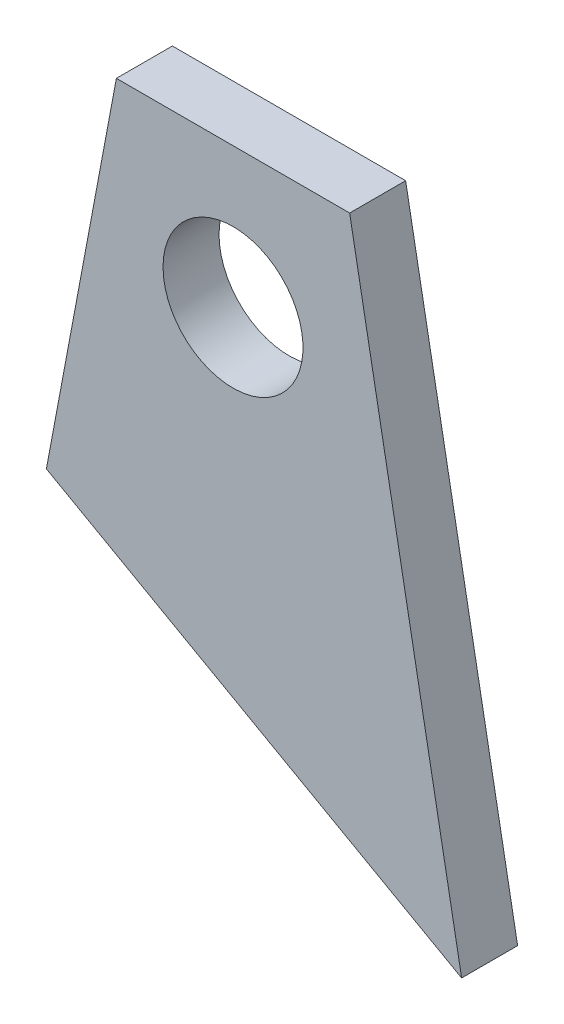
ISO-10303-21;
HEADER;
FILE_DESCRIPTION(('STEP AP214'),'2;1');
FILE_NAME('part.step','',(''),(''),'','','');
FILE_SCHEMA(('AUTOMOTIVE_DESIGN { 1 0 10303 214 1 1 1 1 }'));
ENDSEC;
DATA;
#1=APPLICATION_CONTEXT('core data for automotive mechanical design processes');
#2=APPLICATION_PROTOCOL_DEFINITION('international standard','automotive_design',2000,#1);
#3=PRODUCT_CONTEXT('',#1,'mechanical');
#4=PRODUCT('Part','Part','',(#3));
#5=PRODUCT_RELATED_PRODUCT_CATEGORY('part','',(#4));
#6=PRODUCT_DEFINITION_FORMATION('','',#4);
#7=PRODUCT_DEFINITION_CONTEXT('part definition',#1,'design');
#8=PRODUCT_DEFINITION('design','',#6,#7);
#9=PRODUCT_DEFINITION_SHAPE('','',#8);
#10=(LENGTH_UNIT() NAMED_UNIT(*) SI_UNIT(.MILLI.,.METRE.));
#11=(NAMED_UNIT(*) PLANE_ANGLE_UNIT() SI_UNIT($,.RADIAN.));
#12=(NAMED_UNIT(*) SI_UNIT($,.STERADIAN.) SOLID_ANGLE_UNIT());
#13=UNCERTAINTY_MEASURE_WITH_UNIT(LENGTH_MEASURE(1.E-05),#10,'distance_accuracy_value','');
#14=(GEOMETRIC_REPRESENTATION_CONTEXT(3) GLOBAL_UNCERTAINTY_ASSIGNED_CONTEXT((#13)) GLOBAL_UNIT_ASSIGNED_CONTEXT((#10,
#11,#12)) REPRESENTATION_CONTEXT('',''));
#15=CARTESIAN_POINT('',(0.,0.,0.));
#16=DIRECTION('',(0.,0.,1.));
#17=DIRECTION('',(1.,0.,0.));
#18=AXIS2_PLACEMENT_3D('',#15,#16,#17);
#19=CARTESIAN_POINT('',(-25.,0.,11.9999999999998));
#20=DIRECTION('',(0.,0.,-0.999999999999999));
#21=DIRECTION('',(-1.,0.,0.));
#22=AXIS2_PLACEMENT_3D('',#19,#20,#21);
#23=PLANE('',#22);
#24=DIRECTION('',(-0.184288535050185,-0.982872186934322,0.));
#25=VECTOR('',#24,1.);
#26=CARTESIAN_POINT('',(-40.0000000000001,-79.9999999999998,11.9999999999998));
#27=LINE('',#26,#25);
#28=CARTESIAN_POINT('',(-25.,0.,11.9999999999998));
#29=VERTEX_POINT('',#28);
#30=CARTESIAN_POINT('',(-40.0000000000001,-79.9999999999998,11.9999999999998));
#31=VERTEX_POINT('',#30);
#32=EDGE_CURVE('E110',#29,#31,#27,.T.);
#33=ORIENTED_EDGE('',*,*,#32,.T.);
#34=DIRECTION('',(0.87183702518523,-0.489796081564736,0.));
#35=VECTOR('',#34,1.);
#36=CARTESIAN_POINT('',(48.9999999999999,-130.,12.));
#37=LINE('',#36,#35);
#38=CARTESIAN_POINT('',(48.9999999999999,-130.,12.));
#39=VERTEX_POINT('',#38);
#40=EDGE_CURVE('E95',#31,#39,#37,.T.);
#41=ORIENTED_EDGE('',*,*,#40,.T.);
#42=DIRECTION('',(-0.181547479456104,0.983382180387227,0.));
#43=VECTOR('',#42,1.);
#44=CARTESIAN_POINT('',(25.,2.22044604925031E-13,11.9999999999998));
#45=LINE('',#44,#43);
#46=CARTESIAN_POINT('',(25.,2.22044604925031E-13,11.9999999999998));
#47=VERTEX_POINT('',#46);
#48=EDGE_CURVE('E61',#39,#47,#45,.T.);
#49=ORIENTED_EDGE('',*,*,#48,.T.);
#50=DIRECTION('',(-1.,0.,0.));
#51=VECTOR('',#50,1.);
#52=CARTESIAN_POINT('',(-25.,0.,11.9999999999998));
#53=LINE('',#52,#51);
#54=EDGE_CURVE('E56',#47,#29,#53,.T.);
#55=ORIENTED_EDGE('',*,*,#54,.T.);
#56=EDGE_LOOP('',(#33,#41,#49,#55));
#57=FACE_BOUND('',#56,.T.);
#58=CARTESIAN_POINT('',(1.11022302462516E-13,-29.9999999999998,11.9999999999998));
#59=DIRECTION('',(0.,0.,0.999999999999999));
#60=DIRECTION('',(1.,0.,0.));
#61=AXIS2_PLACEMENT_3D('',#58,#59,#60);
#62=CIRCLE('',#61,15.);
#63=CARTESIAN_POINT('',(-14.9999999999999,-29.9999999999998,11.9999999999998));
#64=VERTEX_POINT('',#63);
#65=EDGE_CURVE('E100',#64,#64,#62,.T.);
#66=ORIENTED_EDGE('',*,*,#65,.F.);
#67=EDGE_LOOP('',(#66));
#68=FACE_BOUND('',#67,.T.);
#69=ADVANCED_FACE('F41',(#57,#68),#23,.F.);
#70=CARTESIAN_POINT('',(-25.,0.,-2.22044604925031E-13));
#71=DIRECTION('',(0.,0.,-0.999999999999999));
#72=DIRECTION('',(-1.,0.,0.));
#73=AXIS2_PLACEMENT_3D('',#70,#71,#72);
#74=PLANE('',#73);
#75=DIRECTION('',(-0.184288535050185,-0.982872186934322,0.));
#76=VECTOR('',#75,1.);
#77=CARTESIAN_POINT('',(-40.0000000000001,-79.9999999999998,-2.22044604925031E-13));
#78=LINE('',#77,#76);
#79=CARTESIAN_POINT('',(-25.,0.,-2.22044604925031E-13));
#80=VERTEX_POINT('',#79);
#81=CARTESIAN_POINT('',(-40.0000000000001,-79.9999999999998,-2.22044604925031E-13));
#82=VERTEX_POINT('',#81);
#83=EDGE_CURVE('E87',#80,#82,#78,.T.);
#84=ORIENTED_EDGE('',*,*,#83,.F.);
#85=DIRECTION('',(-1.,0.,0.));
#86=VECTOR('',#85,1.);
#87=CARTESIAN_POINT('',(-25.,0.,-2.22044604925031E-13));
#88=LINE('',#87,#86);
#89=CARTESIAN_POINT('',(25.,2.22044604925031E-13,-2.22044604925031E-13));
#90=VERTEX_POINT('',#89);
#91=EDGE_CURVE('E108',#90,#80,#88,.T.);
#92=ORIENTED_EDGE('',*,*,#91,.F.);
#93=DIRECTION('',(-0.181547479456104,0.983382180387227,0.));
#94=VECTOR('',#93,1.);
#95=CARTESIAN_POINT('',(25.,2.22044604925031E-13,-2.22044604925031E-13));
#96=LINE('',#95,#94);
#97=CARTESIAN_POINT('',(48.9999999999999,-130.,0.));
#98=VERTEX_POINT('',#97);
#99=EDGE_CURVE('E88',#98,#90,#96,.T.);
#100=ORIENTED_EDGE('',*,*,#99,.F.);
#101=DIRECTION('',(0.87183702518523,-0.489796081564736,0.));
#102=VECTOR('',#101,1.);
#103=CARTESIAN_POINT('',(48.9999999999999,-130.,0.));
#104=LINE('',#103,#102);
#105=EDGE_CURVE('E82',#82,#98,#104,.T.);
#106=ORIENTED_EDGE('',*,*,#105,.F.);
#107=EDGE_LOOP('',(#84,#92,#100,#106));
#108=FACE_BOUND('',#107,.T.);
#109=CARTESIAN_POINT('',(1.11022302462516E-13,-29.9999999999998,-2.22044604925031E-13));
#110=DIRECTION('',(0.,0.,0.999999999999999));
#111=DIRECTION('',(1.,0.,0.));
#112=AXIS2_PLACEMENT_3D('',#109,#110,#111);
#113=CIRCLE('',#112,15.);
#114=CARTESIAN_POINT('',(-14.9999999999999,-29.9999999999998,-2.23779328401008E-13));
#115=VERTEX_POINT('',#114);
#116=EDGE_CURVE('E103',#115,#115,#113,.T.);
#117=ORIENTED_EDGE('',*,*,#116,.T.);
#118=EDGE_LOOP('',(#117));
#119=FACE_BOUND('',#118,.T.);
#120=ADVANCED_FACE('F83',(#108,#119),#74,.T.);
#121=CARTESIAN_POINT('',(-40.0000000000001,-79.9999999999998,11.9999999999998));
#122=DIRECTION('',(0.982872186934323,-0.184288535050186,0.));
#123=DIRECTION('',(0.184288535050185,0.982872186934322,0.));
#124=AXIS2_PLACEMENT_3D('',#121,#122,#123);
#125=PLANE('',#124);
#126=ORIENTED_EDGE('',*,*,#83,.T.);
#127=DIRECTION('',(0.,0.,-0.999999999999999));
#128=VECTOR('',#127,1.);
#129=CARTESIAN_POINT('',(-40.0000000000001,-79.9999999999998,11.9999999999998));
#130=LINE('',#129,#128);
#131=EDGE_CURVE('E11',#31,#82,#130,.T.);
#132=ORIENTED_EDGE('',*,*,#131,.F.);
#133=ORIENTED_EDGE('',*,*,#32,.F.);
#134=DIRECTION('',(0.,0.,-0.999999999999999));
#135=VECTOR('',#134,1.);
#136=CARTESIAN_POINT('',(-25.,0.,11.9999999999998));
#137=LINE('',#136,#135);
#138=EDGE_CURVE('E99',#29,#80,#137,.T.);
#139=ORIENTED_EDGE('',*,*,#138,.T.);
#140=EDGE_LOOP('',(#126,#132,#133,#139));
#141=FACE_BOUND('',#140,.T.);
#142=ADVANCED_FACE('F43',(#141),#125,.F.);
#143=CARTESIAN_POINT('',(48.9999999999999,-130.,12.));
#144=DIRECTION('',(0.489796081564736,0.87183702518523,0.));
#145=DIRECTION('',(-0.87183702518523,0.489796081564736,0.));
#146=AXIS2_PLACEMENT_3D('',#143,#144,#145);
#147=PLANE('',#146);
#148=ORIENTED_EDGE('',*,*,#105,.T.);
#149=DIRECTION('',(0.,0.,-0.999999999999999));
#150=VECTOR('',#149,1.);
#151=CARTESIAN_POINT('',(48.9999999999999,-130.,12.));
#152=LINE('',#151,#150);
#153=EDGE_CURVE('E49',#39,#98,#152,.T.);
#154=ORIENTED_EDGE('',*,*,#153,.F.);
#155=ORIENTED_EDGE('',*,*,#40,.F.);
#156=ORIENTED_EDGE('',*,*,#131,.T.);
#157=EDGE_LOOP('',(#148,#154,#155,#156));
#158=FACE_BOUND('',#157,.T.);
#159=ADVANCED_FACE('F94',(#158),#147,.F.);
#160=CARTESIAN_POINT('',(25.,2.22044604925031E-13,11.9999999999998));
#161=DIRECTION('',(-0.983382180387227,-0.181547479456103,0.));
#162=DIRECTION('',(0.181547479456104,-0.983382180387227,0.));
#163=AXIS2_PLACEMENT_3D('',#160,#161,#162);
#164=PLANE('',#163);
#165=ORIENTED_EDGE('',*,*,#99,.T.);
#166=DIRECTION('',(0.,0.,-0.999999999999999));
#167=VECTOR('',#166,1.);
#168=CARTESIAN_POINT('',(25.,2.22044604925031E-13,11.9999999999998));
#169=LINE('',#168,#167);
#170=EDGE_CURVE('E116',#47,#90,#169,.T.);
#171=ORIENTED_EDGE('',*,*,#170,.F.);
#172=ORIENTED_EDGE('',*,*,#48,.F.);
#173=ORIENTED_EDGE('',*,*,#153,.T.);
#174=EDGE_LOOP('',(#165,#171,#172,#173));
#175=FACE_BOUND('',#174,.T.);
#176=ADVANCED_FACE('F119',(#175),#164,.F.);
#177=CARTESIAN_POINT('',(-25.,0.,11.9999999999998));
#178=DIRECTION('',(0.,-1.,0.));
#179=DIRECTION('',(0.,0.,-0.999999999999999));
#180=AXIS2_PLACEMENT_3D('',#177,#178,#179);
#181=PLANE('',#180);
#182=ORIENTED_EDGE('',*,*,#91,.T.);
#183=ORIENTED_EDGE('',*,*,#138,.F.);
#184=ORIENTED_EDGE('',*,*,#54,.F.);
#185=ORIENTED_EDGE('',*,*,#170,.T.);
#186=EDGE_LOOP('',(#182,#183,#184,#185));
#187=FACE_BOUND('',#186,.T.);
#188=ADVANCED_FACE('F121',(#187),#181,.F.);
#189=CARTESIAN_POINT('',(1.11022302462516E-13,-29.9999999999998,11.9999999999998));
#190=DIRECTION('',(0.,0.,-0.999999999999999));
#191=DIRECTION('',(-1.,0.,0.));
#192=AXIS2_PLACEMENT_3D('',#189,#190,#191);
#193=CYLINDRICAL_SURFACE('',#192,15.);
#194=CARTESIAN_POINT('',(-14.9999999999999,-29.9999999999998,11.9999999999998));
#195=CARTESIAN_POINT('',(-14.9999999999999,-29.9999999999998,11.8749999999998));
#196=CARTESIAN_POINT('',(-14.9999999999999,-29.9999999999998,11.7499999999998));
#197=CARTESIAN_POINT('',(-14.9999999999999,-29.9999999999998,11.4999999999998));
#198=CARTESIAN_POINT('',(-14.9999999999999,-29.9999999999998,11.3749999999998));
#199=CARTESIAN_POINT('',(-14.9999999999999,-29.9999999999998,11.1249999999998));
#200=CARTESIAN_POINT('',(-14.9999999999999,-29.9999999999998,10.9999999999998));
#201=CARTESIAN_POINT('',(-14.9999999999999,-29.9999999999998,10.7499999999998));
#202=CARTESIAN_POINT('',(-14.9999999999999,-29.9999999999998,10.6249999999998));
#203=CARTESIAN_POINT('',(-14.9999999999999,-29.9999999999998,10.3749999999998));
#204=CARTESIAN_POINT('',(-14.9999999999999,-29.9999999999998,10.2499999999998));
#205=CARTESIAN_POINT('',(-14.9999999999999,-29.9999999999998,9.99999999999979));
#206=CARTESIAN_POINT('',(-14.9999999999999,-29.9999999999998,9.87499999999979));
#207=CARTESIAN_POINT('',(-14.9999999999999,-29.9999999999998,9.62499999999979));
#208=CARTESIAN_POINT('',(-14.9999999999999,-29.9999999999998,9.49999999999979));
#209=CARTESIAN_POINT('',(-14.9999999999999,-29.9999999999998,9.24999999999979));
#210=CARTESIAN_POINT('',(-14.9999999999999,-29.9999999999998,9.12499999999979));
#211=CARTESIAN_POINT('',(-14.9999999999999,-29.9999999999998,8.87499999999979));
#212=CARTESIAN_POINT('',(-14.9999999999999,-29.9999999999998,8.74999999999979));
#213=CARTESIAN_POINT('',(-14.9999999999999,-29.9999999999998,8.49999999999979));
#214=CARTESIAN_POINT('',(-14.9999999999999,-29.9999999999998,8.37499999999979));
#215=CARTESIAN_POINT('',(-14.9999999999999,-29.9999999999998,8.12499999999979));
#216=CARTESIAN_POINT('',(-14.9999999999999,-29.9999999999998,7.99999999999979));
#217=CARTESIAN_POINT('',(-14.9999999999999,-29.9999999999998,7.74999999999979));
#218=CARTESIAN_POINT('',(-14.9999999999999,-29.9999999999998,7.62499999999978));
#219=CARTESIAN_POINT('',(-14.9999999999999,-29.9999999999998,7.37499999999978));
#220=CARTESIAN_POINT('',(-14.9999999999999,-29.9999999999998,7.24999999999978));
#221=CARTESIAN_POINT('',(-14.9999999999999,-29.9999999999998,6.99999999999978));
#222=CARTESIAN_POINT('',(-14.9999999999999,-29.9999999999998,6.87499999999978));
#223=CARTESIAN_POINT('',(-14.9999999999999,-29.9999999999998,6.62499999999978));
#224=CARTESIAN_POINT('',(-14.9999999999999,-29.9999999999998,6.49999999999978));
#225=CARTESIAN_POINT('',(-14.9999999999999,-29.9999999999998,6.24999999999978));
#226=CARTESIAN_POINT('',(-14.9999999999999,-29.9999999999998,6.12499999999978));
#227=CARTESIAN_POINT('',(-14.9999999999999,-29.9999999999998,5.87499999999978));
#228=CARTESIAN_POINT('',(-14.9999999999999,-29.9999999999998,5.74999999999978));
#229=CARTESIAN_POINT('',(-14.9999999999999,-29.9999999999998,5.49999999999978));
#230=CARTESIAN_POINT('',(-14.9999999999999,-29.9999999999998,5.37499999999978));
#231=CARTESIAN_POINT('',(-14.9999999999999,-29.9999999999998,5.12499999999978));
#232=CARTESIAN_POINT('',(-14.9999999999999,-29.9999999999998,4.99999999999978));
#233=CARTESIAN_POINT('',(-14.9999999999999,-29.9999999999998,4.74999999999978));
#234=CARTESIAN_POINT('',(-14.9999999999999,-29.9999999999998,4.62499999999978));
#235=CARTESIAN_POINT('',(-14.9999999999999,-29.9999999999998,4.37499999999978));
#236=CARTESIAN_POINT('',(-14.9999999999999,-29.9999999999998,4.24999999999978));
#237=CARTESIAN_POINT('',(-14.9999999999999,-29.9999999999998,3.99999999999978));
#238=CARTESIAN_POINT('',(-14.9999999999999,-29.9999999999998,3.87499999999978));
#239=CARTESIAN_POINT('',(-14.9999999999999,-29.9999999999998,3.62499999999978));
#240=CARTESIAN_POINT('',(-14.9999999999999,-29.9999999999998,3.49999999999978));
#241=CARTESIAN_POINT('',(-14.9999999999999,-29.9999999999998,3.24999999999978));
#242=CARTESIAN_POINT('',(-14.9999999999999,-29.9999999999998,3.12499999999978));
#243=CARTESIAN_POINT('',(-14.9999999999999,-29.9999999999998,2.87499999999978));
#244=CARTESIAN_POINT('',(-14.9999999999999,-29.9999999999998,2.74999999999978));
#245=CARTESIAN_POINT('',(-14.9999999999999,-29.9999999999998,2.49999999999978));
#246=CARTESIAN_POINT('',(-14.9999999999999,-29.9999999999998,2.37499999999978));
#247=CARTESIAN_POINT('',(-14.9999999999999,-29.9999999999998,2.12499999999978));
#248=CARTESIAN_POINT('',(-14.9999999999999,-29.9999999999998,1.99999999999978));
#249=CARTESIAN_POINT('',(-14.9999999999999,-29.9999999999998,1.74999999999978));
#250=CARTESIAN_POINT('',(-14.9999999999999,-29.9999999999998,1.62499999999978));
#251=CARTESIAN_POINT('',(-14.9999999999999,-29.9999999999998,1.37499999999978));
#252=CARTESIAN_POINT('',(-14.9999999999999,-29.9999999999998,1.24999999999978));
#253=CARTESIAN_POINT('',(-14.9999999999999,-29.9999999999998,0.999999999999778));
#254=CARTESIAN_POINT('',(-14.9999999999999,-29.9999999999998,0.874999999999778));
#255=CARTESIAN_POINT('',(-14.9999999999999,-29.9999999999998,0.624999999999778));
#256=CARTESIAN_POINT('',(-14.9999999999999,-29.9999999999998,0.499999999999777));
#257=CARTESIAN_POINT('',(-14.9999999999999,-29.9999999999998,0.249999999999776));
#258=CARTESIAN_POINT('',(-14.9999999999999,-29.9999999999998,0.124999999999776));
#259=CARTESIAN_POINT('',(-14.9999999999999,-29.9999999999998,-2.23779328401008E-13));
#260=B_SPLINE_CURVE_WITH_KNOTS('',3,(#194,#195,#196,#197,#198,#199,#200,#201,#202,#203,#204,
#205,#206,#207,#208,#209,#210,#211,#212,#213,#214,#215,#216,#217,#218,#219,#220,#221,#222,#223,
#224,#225,#226,#227,#228,#229,#230,#231,#232,#233,#234,#235,#236,#237,#238,#239,#240,#241,#242,
#243,#244,#245,#246,#247,#248,#249,#250,#251,#252,#253,#254,#255,#256,#257,#258,#259),
.UNSPECIFIED.,.F.,.F.,(4,2,2,2,2,2,2,2,2,2,2,2,2,2,2,2,2,2,2,2,2,2,2,2,2,2,2,2,2,2,2,2,4),(0.,
0.374999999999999,0.749999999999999,1.125,1.5,1.875,2.25,2.625,3.,3.375,3.75,4.125,4.5,4.875,
5.25,5.625,6.,6.375,6.75000000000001,7.12500000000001,7.50000000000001,7.87500000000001,
8.25000000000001,8.62500000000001,9.00000000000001,9.37500000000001,9.75000000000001,10.125,
10.5,10.875,11.25,11.625,12.),.UNSPECIFIED.);
#261=EDGE_CURVE('BSEAM127',#64,#115,#260,.T.);
#262=ORIENTED_EDGE('',*,*,#65,.T.);
#263=ORIENTED_EDGE('',*,*,#116,.F.);
#264=ORIENTED_EDGE('',*,*,#261,.T.);
#265=ORIENTED_EDGE('',*,*,#261,.F.);
#266=EDGE_LOOP('',(#262,#264,#263,#265));
#267=FACE_BOUND('',#266,.T.);
#268=ADVANCED_FACE('F127',(#267),#193,.F.);
#269=CLOSED_SHELL('',(#69,#120,#142,#159,#176,#188,#268));
#270=MANIFOLD_SOLID_BREP('B2',#269);
#271=ADVANCED_BREP_SHAPE_REPRESENTATION('',(#18,#270),#14);
#272=SHAPE_DEFINITION_REPRESENTATION(#9,#271);
ENDSEC;
END-ISO-10303-21;
